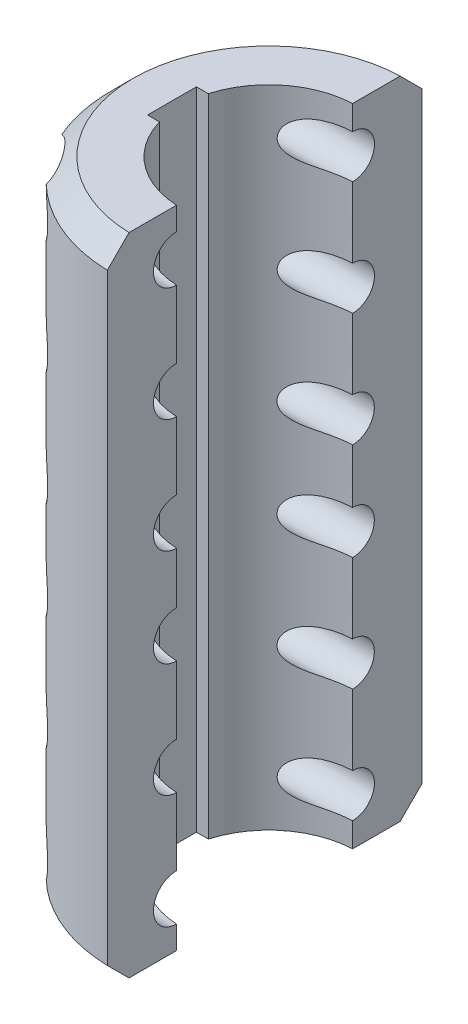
from build123d import *

# Parameters (mm, degrees)
ESQUISSE1_R      = 58
EXTRUSION1_DEPTH = 238
ESQUISSE2_W      = 70.539152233
ESQUISSE2_H      = 116
EXTRUSION2_DEPTH = 262
CHANFREIN1_SIZE  = 8
ESQUISSE3_R      = 8
EXTRUSION3_DEPTH = 252.733490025
ESQUISSE7_R      = 8.5
EXTRUSION4_DEPTH = 30.5
ESQUISSE8_R      = 13
EXTRUSION5_DEPTH = 30.5


with BuildPart() as part:
    # Esquisse1 → Extrusion1 (new body)
    with BuildSketch(Plane(origin=(0, 0, 0), x_dir=(1, 0, 0), z_dir=(0, 1, 0))):
        with Locations(Location((0, 0, 0), (0, 0, 270))):
            Circle(ESQUISSE1_R)
        with BuildLine():
            Line((-31.228992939, -9), (-35.628992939, -9))
            Line((-35.628992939, -9), (-35.628992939, 9))
            Line((-35.628992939, 9), (-31.228992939, 9))
            ThreePointArc((-31.228992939, 9), (32.5, 0), (-31.228992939, -9))
        make_face(mode=Mode.SUBTRACT)
    extrude(amount=EXTRUSION1_DEPTH)

    # Esquisse2 → Extrusion2 (cut)
    with BuildSketch(Plane(origin=(0, 238, 0), x_dir=(1, 0, 0), z_dir=(0, 1, 0))):
        with Locations((33.769576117, 0)):
            Rectangle(ESQUISSE2_W, ESQUISSE2_H)
    extrude(amount=-EXTRUSION2_DEPTH, mode=Mode.SUBTRACT)

    # Chanfrein1
    chanfrein1_edges = [part.edges().sort_by_distance(p)[0] for p in [
        (-58, 238, 0),
        (-58, 0, 0),
    ]]
    chamfer(chanfrein1_edges, length=CHANFREIN1_SIZE)

    # Esquisse3 → Extrusion3 (cut, through all)
    with BuildSketch(Plane(origin=(0, 0, 0), x_dir=(0, 0, -1), z_dir=(1, 0, 0))):
        with Locations((32.5, 17)):
            Circle(ESQUISSE3_R)
        with Locations((32.465366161, 59)):
            Circle(ESQUISSE3_R)
        with Locations((32.465366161, 101)):
            Circle(ESQUISSE3_R)
        with Locations((32.465366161, 137)):
            Circle(ESQUISSE3_R)
        with Locations((32.5, 179)):
            Circle(ESQUISSE3_R)
        with Locations((32.5, 221)):
            Circle(ESQUISSE3_R)
    extrude(amount=-EXTRUSION3_DEPTH, mode=Mode.SUBTRACT)

    # Esquisse7 → Extrusion4 (cut)
    with BuildSketch(Plane(origin=(-1.5, 0, 0), x_dir=(0, 0, -1), z_dir=(1, 0, 0))):
        with Locations((-32.465366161, 17)):
            Circle(ESQUISSE7_R)
        with Locations((-32.465366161, 59)):
            Circle(ESQUISSE7_R)
        with Locations((-32.465366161, 101)):
            Circle(ESQUISSE7_R)
        with Locations((-32.465366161, 137)):
            Circle(ESQUISSE7_R)
        with Locations((-32.465366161, 179)):
            Circle(ESQUISSE7_R)
        with Locations((-32.465366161, 221)):
            Circle(ESQUISSE7_R)
    extrude(amount=-EXTRUSION4_DEPTH, mode=Mode.SUBTRACT)

    # Esquisse8 → Extrusion5 (cut)
    with BuildSketch(Plane(origin=(-32, 0, 0), x_dir=(0, 0, -1), z_dir=(1, 0, 0))):
        with Locations((-32.465366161, 101)):
            Circle(ESQUISSE8_R)
        with Locations((-32.465366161, 137)):
            Circle(ESQUISSE8_R)
        with Locations((-32.465366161, 59)):
            Circle(ESQUISSE8_R)
        with Locations((-32.465366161, 17)):
            Circle(ESQUISSE8_R)
        with Locations((-32.465366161, 179)):
            Circle(ESQUISSE8_R)
        with Locations((-32.465366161, 221)):
            Circle(ESQUISSE8_R)
    extrude(amount=-EXTRUSION5_DEPTH, mode=Mode.SUBTRACT)


solid = part.part
